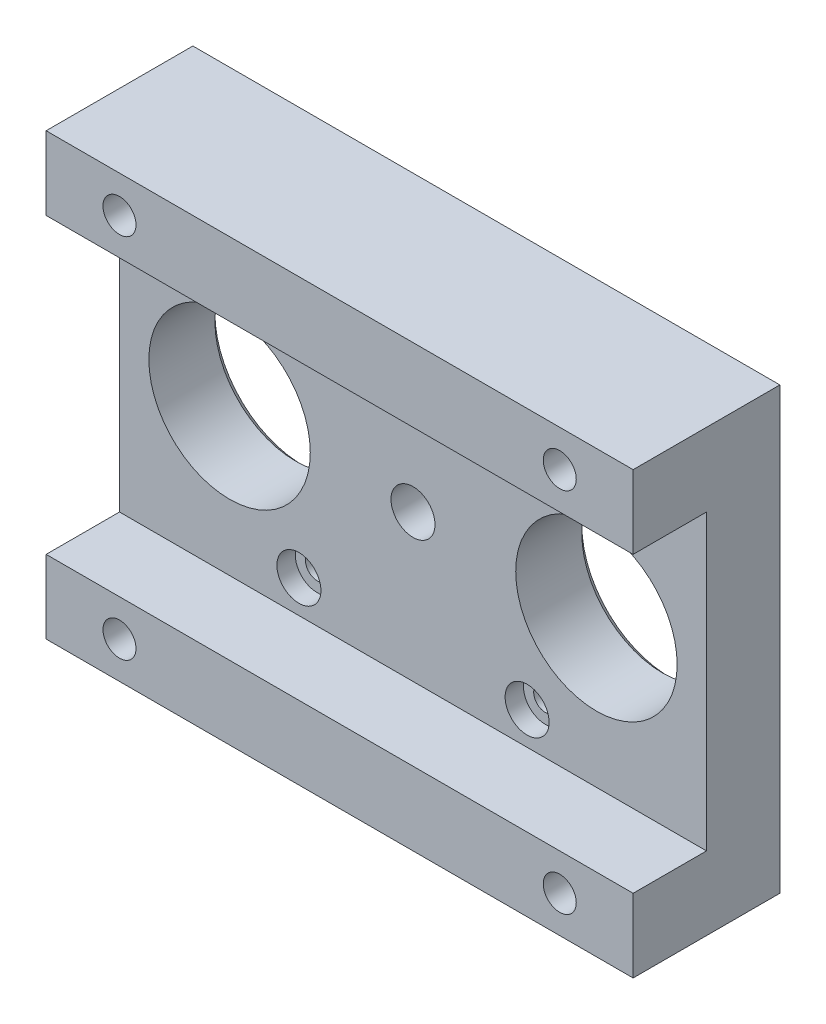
from build123d import *

# Parameters (mm, degrees)
SKIZZE1_W                       = 80
SKIZZE1_H                       = 60
AUFSATZ_LINEAR_AUSTRAGEN1_DEPTH = 10
SKIZZE2_W                       = 80
SKIZZE2_H                       = 10
AUFSATZ_LINEAR_AUSTRAGEN2_DEPTH = 10
SKIZZE3_R                       = 11.35
SCHNITT_LINEAR_AUSTRAGEN1_DEPTH = 2.2
SKIZZE4_R                       = 3
SCHNITT_LINEAR_AUSTRAGEN2_DEPTH = 12.2
SKIZZE5_R                       = 2.25
SCHNITT_LINEAR_AUSTRAGEN3_DEPTH = 12.2
SKIZZE6_R                       = 11
SCHNITT_LINEAR_AUSTRAGEN4_DEPTH = 12.2
SKIZZE7_R                       = 1.6
SCHNITT_LINEAR_AUSTRAGEN5_DEPTH = 12.2
SKIZZE8_R                       = 3
SCHNITT_LINEAR_AUSTRAGEN6_DEPTH = 2.5
FASE1_SIZE                      = 1


with BuildPart() as part:
    # Skizze1 → Aufsatz-Linear austragen1 (new body)
    with BuildSketch(Plane.XY):
        Rectangle(SKIZZE1_W, SKIZZE1_H)
    extrude(amount=AUFSATZ_LINEAR_AUSTRAGEN1_DEPTH)

    # Skizze2 → Aufsatz-Linear austragen2 (add)
    with BuildSketch(Plane.XY.offset(10)):
        with Locations((0, 25)):
            Rectangle(SKIZZE2_W, SKIZZE2_H)
        with Locations((0, -25)):
            Rectangle(SKIZZE2_W, SKIZZE2_H)
    extrude(amount=AUFSATZ_LINEAR_AUSTRAGEN2_DEPTH)

    # Skizze3 → Schnitt-Linear austragen1 (cut)
    with BuildSketch(Plane(origin=(0, 0, 0), x_dir=(-1, 0, 0), z_dir=(0, 0, -1))):
        Circle(SKIZZE3_R)
    extrude(amount=-SCHNITT_LINEAR_AUSTRAGEN1_DEPTH, mode=Mode.SUBTRACT)

    # Skizze4 → Schnitt-Linear austragen2 (cut)
    with BuildSketch(Plane(origin=(0, 0, 2.2), x_dir=(-1, 0, 0), z_dir=(0, 0, -1))):
        Circle(SKIZZE4_R)
    extrude(amount=-SCHNITT_LINEAR_AUSTRAGEN2_DEPTH, mode=Mode.SUBTRACT)

    # Skizze5 → Schnitt-Linear austragen3 (cut)
    with BuildSketch(Plane.XY.offset(20)):
        with Locations((30, 25)):
            Circle(SKIZZE5_R)
        with Locations((-30, 25)):
            Circle(SKIZZE5_R)
        with Locations((-30, -25)):
            Circle(SKIZZE5_R)
        with Locations((30, -25)):
            Circle(SKIZZE5_R)
    extrude(amount=-SCHNITT_LINEAR_AUSTRAGEN3_DEPTH, mode=Mode.SUBTRACT)

    # Skizze6 → Schnitt-Linear austragen4 (cut)
    with BuildSketch(Plane.XY.offset(10)):
        with Locations((-25, 0)):
            Circle(SKIZZE6_R)
        with Locations((25, 0)):
            Circle(SKIZZE6_R)
    extrude(amount=-SCHNITT_LINEAR_AUSTRAGEN4_DEPTH, mode=Mode.SUBTRACT)

    # Skizze7 → Schnitt-Linear austragen5 (cut)
    with BuildSketch(Plane.XY.offset(10)):
        with Locations((-15.55, 15.55)):
            Circle(SKIZZE7_R)
        with Locations((15.55, 15.55)):
            Circle(SKIZZE7_R)
        with Locations((15.55, -15.55)):
            Circle(SKIZZE7_R)
        with Locations((-15.55, -15.55)):
            Circle(SKIZZE7_R)
    extrude(amount=-SCHNITT_LINEAR_AUSTRAGEN5_DEPTH, mode=Mode.SUBTRACT)

    # Skizze8 → Schnitt-Linear austragen6 (cut)
    with BuildSketch(Plane.XY.offset(10)):
        with Locations((-15.55, 15.55)):
            Circle(SKIZZE8_R)
        with Locations((15.55, 15.55)):
            Circle(SKIZZE8_R)
        with Locations((-15.55, -15.55)):
            Circle(SKIZZE8_R)
        with Locations((15.55, -15.55)):
            Circle(SKIZZE8_R)
    extrude(amount=-SCHNITT_LINEAR_AUSTRAGEN6_DEPTH, mode=Mode.SUBTRACT)

    # Fase1
    fase1_edges = [part.edges().sort_by_distance(p)[0] for p in [
        (-36, 0, 0),
        (14, 0, 0),
    ]]
    chamfer(fase1_edges, length=FASE1_SIZE)


solid = part.part
